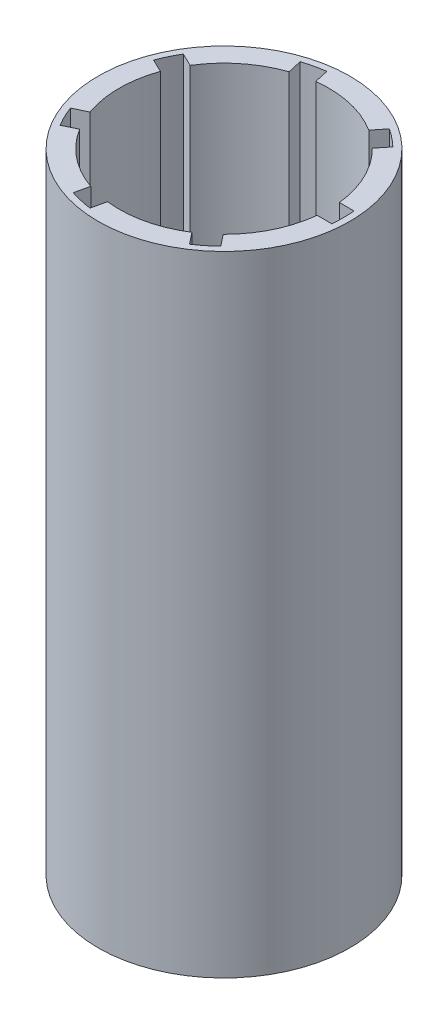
from build123d import *

# Parameters (mm, degrees)
ESQUISSE1_R      = 39
EXTRUSION1_DEPTH = 195


with BuildPart() as part:
    # Esquisse1 → Extrusion1 (new body)
    with BuildSketch(Plane(origin=(0, 0, 0), x_dir=(1, 0, 0), z_dir=(0, 1, 0))):
        with Locations(Location((0, 0, 0), (0, 0, 270))):
            Circle(ESQUISSE1_R)
        with BuildLine():
            Line((36.852281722, -3.450551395), (32.316306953, -3.450551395))
            ThreePointArc((32.316306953, -3.450551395), (29.281488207, -14.101221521), (22.846637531, -23.114522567))
            Line((22.846637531, -23.114522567), (25.674771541, -26.660890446))
            ThreePointArc((25.674771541, -26.660890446), (23.077521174, -28.938296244), (20.279272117, -30.963657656))
            Line((20.279272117, -30.963657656), (17.451138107, -27.417289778))
            ThreePointArc((17.451138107, -27.417289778), (7.231930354, -31.685157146), (-3.827015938, -32.273889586))
            Line((-3.827015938, -32.273889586), (-4.83636528, -36.696137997))
            ThreePointArc((-4.83636528, -36.696137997), (-8.236271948, -36.085465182), (-11.564443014, -35.160498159))
            Line((-11.564443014, -35.160498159), (-10.555093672, -30.738249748))
            ThreePointArc((-10.555093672, -30.738249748), (-20.26341856, -25.40952318), (-27.618848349, -17.130359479))
            Line((-27.618848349, -17.130359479), (-31.705620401, -19.098445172))
            ThreePointArc((-31.705620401, -19.098445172), (-33.347984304, -16.059542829), (-34.699896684, -12.880766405))
            Line((-34.699896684, -12.880766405), (-30.613124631, -10.912680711))
            ThreePointArc((-30.613124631, -10.912680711), (-32.5, 0), (-30.613124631, 10.912680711))
            Line((-30.613124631, 10.912680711), (-34.699896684, 12.880766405))
            ThreePointArc((-34.699896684, 12.880766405), (-33.347984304, 16.059542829), (-31.705620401, 19.098445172))
            Line((-31.705620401, 19.098445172), (-27.618848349, 17.130359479))
            ThreePointArc((-27.618848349, 17.130359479), (-20.26341856, 25.40952318), (-10.555093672, 30.738249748))
            Line((-10.555093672, 30.738249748), (-11.564443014, 35.160498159))
            ThreePointArc((-11.564443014, 35.160498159), (-8.236271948, 36.085465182), (-4.83636528, 36.696137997))
            Line((-4.83636528, 36.696137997), (-3.827015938, 32.273889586))
            ThreePointArc((-3.827015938, 32.273889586), (7.231930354, 31.685157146), (17.451138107, 27.417289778))
            Line((17.451138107, 27.417289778), (20.279272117, 30.963657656))
            ThreePointArc((20.279272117, 30.963657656), (23.077521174, 28.938296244), (25.674771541, 26.660890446))
            Line((25.674771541, 26.660890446), (22.846637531, 23.114522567))
            ThreePointArc((22.846637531, 23.114522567), (29.281488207, 14.101221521), (32.316306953, 3.450551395))
            Line((32.316306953, 3.450551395), (36.852281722, 3.450551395))
            ThreePointArc((36.852281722, 3.450551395), (37.013470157, 0), (36.852281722, -3.450551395))
        make_face(mode=Mode.SUBTRACT)
    extrude(amount=EXTRUSION1_DEPTH)


solid = part.part
